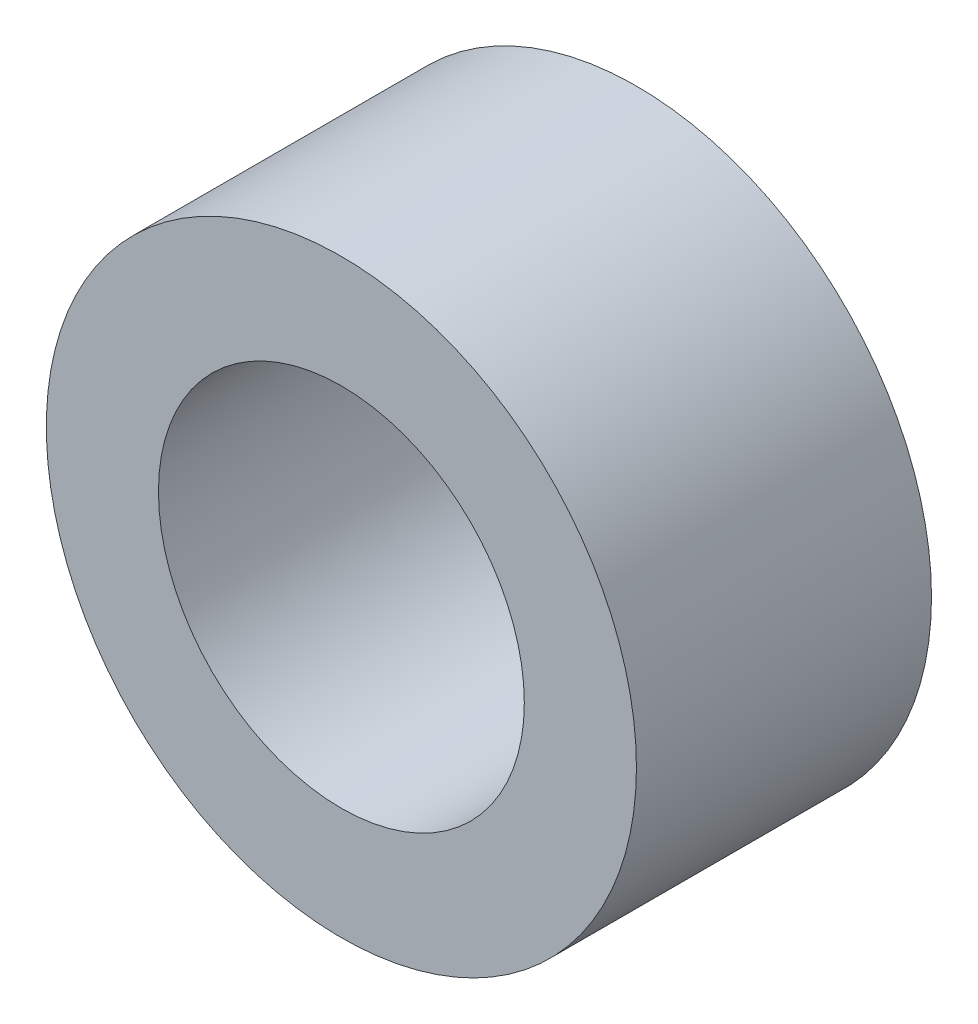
from build123d import *

# Parameters (mm, degrees)
SKETCH_1_R                        = 5
SKETCH_1_R_2                      = 3.1
FLANGED_PIVOT_BUSH_ENVELOPE_DEPTH = 2.5


with BuildPart() as part:
    # Sketch 1 → Flanged_Pivot_Bush_Envelope (new, symmetric)
    with BuildSketch(Plane.XY):
        Circle(SKETCH_1_R)
        Circle(SKETCH_1_R_2, mode=Mode.SUBTRACT)
    extrude(amount=FLANGED_PIVOT_BUSH_ENVELOPE_DEPTH, both=True)


solid = part.part
